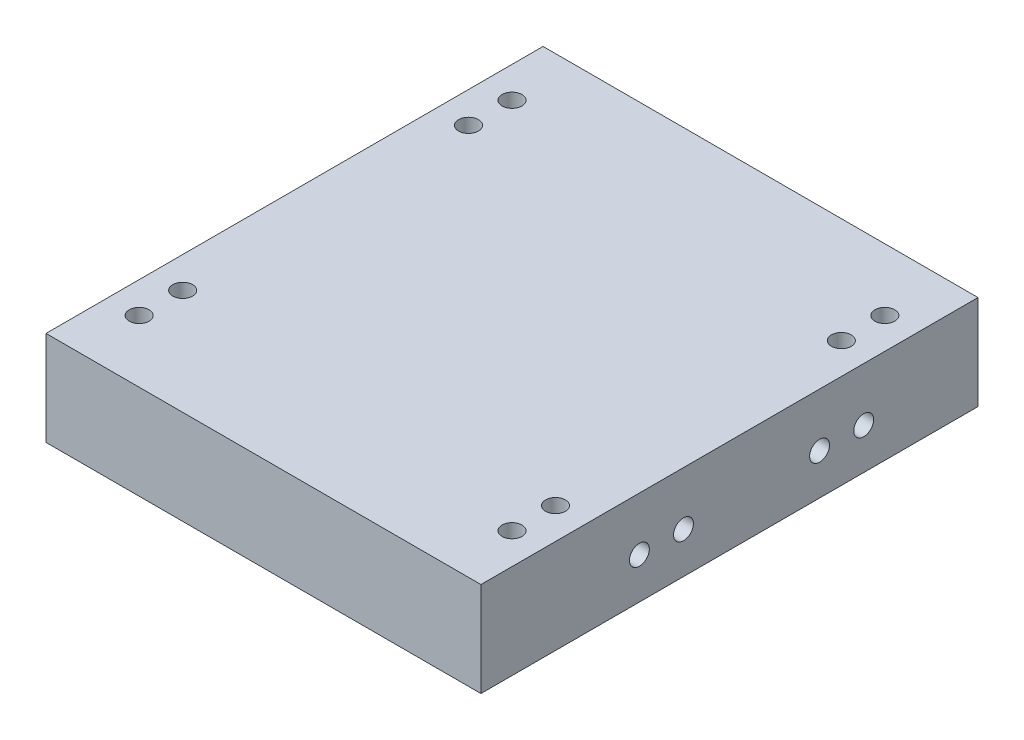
from build123d import *

# Parameters (mm, degrees)
SKETCH1_W           = 44.45
SKETCH1_H           = 50.8
BOSS_EXTRUDE1_DEPTH = 9.652
SKETCH2_R           = 1.016
CUT_EXTRUDE1_DEPTH  = 36.103728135
SKETCH13_R          = 1.016
CUT_EXTRUDE2_DEPTH  = 10.16
CUT_EXTRUDE3_START  = -10.16
SKETCH18_R          = 1.016
CUT_EXTRUDE3_DEPTH  = 10.16
SKETCH21_R          = 1.016
CUT_EXTRUDE4_DEPTH  = 36.103728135
SKETCH24_R          = 1.016
CUT_EXTRUDE5_DEPTH  = 10.16
CUT_EXTRUDE6_START  = -10.16
SKETCH25_R          = 1.016
CUT_EXTRUDE6_DEPTH  = 10.16


with BuildPart() as part:
    # Sketch1 → Boss-Extrude1 (new body)
    with BuildSketch(Plane(origin=(0, 0, 0), x_dir=(1, 0, 0), z_dir=(0, 1, 0))):
        Rectangle(SKETCH1_W, SKETCH1_H)
    extrude(amount=BOSS_EXTRUDE1_DEPTH)

    # Sketch2 → Cut-Extrude1 (cut, through all)
    with BuildSketch(Plane(origin=(0, 9.652, 0), x_dir=(1, 0, 0), z_dir=(0, 1, 0))):
        with Locations(Location((-19.05, 19.05, 0), (0, 0, 270))):
            Circle(SKETCH2_R)
        with Locations(Location((19.05, 19.05, 0), (0, 0, 270))):
            Circle(SKETCH2_R)
        with Locations(Location((19.05, -19.05, 0), (0, 0, 270))):
            Circle(SKETCH2_R)
        with Locations(Location((-19.05, -19.05, 0), (0, 0, 270))):
            Circle(SKETCH2_R)
    extrude(amount=-CUT_EXTRUDE1_DEPTH, mode=Mode.SUBTRACT)

    # Sketch13 → Cut-Extrude2 (cut)
    with BuildSketch(Plane.ZY.offset(22.225)):
        with Locations((-13.716, 4.191)):
            Circle(SKETCH13_R)
        with Locations((4.699, 4.191)):
            Circle(SKETCH13_R)
    extrude(amount=-CUT_EXTRUDE2_DEPTH, mode=Mode.SUBTRACT)

    # Sketch18 → Cut-Extrude3 (cut)
    with BuildSketch(Plane(origin=(22.225, 0, 0), x_dir=(0, 0, -1), z_dir=(1, 0, 0)).offset(CUT_EXTRUDE3_START)):
        with Locations(Location((13.716, 4.191, 0), (0, 0, 180))):
            Circle(SKETCH18_R)
        with Locations(Location((-4.699, 4.191, 0), (0, 0, 180))):
            Circle(SKETCH18_R)
    extrude(amount=CUT_EXTRUDE3_DEPTH, mode=Mode.SUBTRACT)

    # Sketch21 → Cut-Extrude4 (cut, through all)
    with BuildSketch(Plane(origin=(0, 9.652, 0), x_dir=(1, 0, 0), z_dir=(0, 1, 0))):
        with Locations(Location((-19.05, 14.605, 0), (0, 0, 270))):
            Circle(SKETCH21_R)
        with Locations(Location((19.05, 14.605, 0), (0, 0, 270))):
            Circle(SKETCH21_R)
        with Locations(Location((-19.05, -14.605, 0), (0, 0, 270))):
            Circle(SKETCH21_R)
        with Locations(Location((19.05, -14.605, 0), (0, 0, 270))):
            Circle(SKETCH21_R)
    extrude(amount=-CUT_EXTRUDE4_DEPTH, mode=Mode.SUBTRACT)

    # Sketch24 → Cut-Extrude5 (cut)
    with BuildSketch(Plane(origin=(22.225, 0, 0), x_dir=(0, 0, -1), z_dir=(1, 0, 0))):
        with Locations((9.2075, 4.191)):
            Circle(SKETCH24_R)
        with Locations((-9.2075, 4.191)):
            Circle(SKETCH24_R)
    extrude(amount=-CUT_EXTRUDE5_DEPTH, mode=Mode.SUBTRACT)

    # Sketch25 → Cut-Extrude6 (cut)
    with BuildSketch(Plane.ZY.offset(22.225).offset(CUT_EXTRUDE6_START)):
        with Locations(Location((-9.2075, 4.191, 0), (0, 0, 180))):
            Circle(SKETCH25_R)
        with Locations(Location((9.2075, 4.191, 0), (0, 0, 180))):
            Circle(SKETCH25_R)
    extrude(amount=CUT_EXTRUDE6_DEPTH, mode=Mode.SUBTRACT)


solid = part.part
